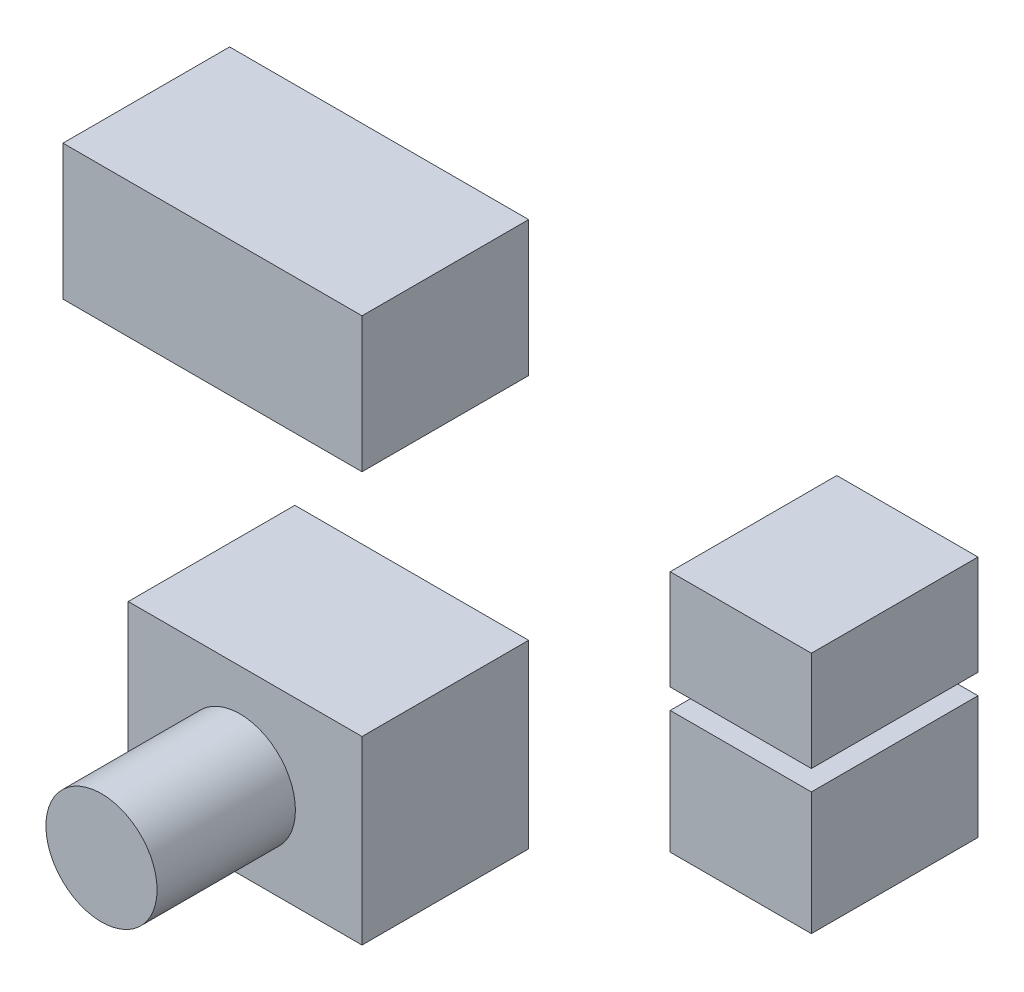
from build123d import *

# Parameters (mm, degrees)
SKETCH1_W          = 48.320688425
SKETCH1_H          = 21.83015873
EXTRUDE1_DEPTH     = 26.924
SKETCH1_W_2        = 22.81128946
SKETCH1_H_2        = 39.245229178
EXTRUDE1_2_DEPTH   = 26.924
SKETCH1_W_3        = 37.773533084
SKETCH1_H_3        = 29.188639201
EXTRUDE1_3_DEPTH   = 26.924
SKETCH3_R          = 8.982471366
EXTRUDE2_DEPTH     = 22.352
SKETCH4_W          = 32.540651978
SKETCH4_H          = 3.272651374
CUT_EXTRUDE2_DEPTH = 91.916895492


with BuildPart() as part:
    # Sketch1 → Extrude1 (new body)
    with BuildSketch(Plane.XY):
        with Locations((-46.726350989, 39.245229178)):
            Rectangle(SKETCH1_W, SKETCH1_H)
    extrude(amount=EXTRUDE1_DEPTH)


with BuildPart() as body_2:
    # Sketch1 → Extrude1 2 (new body)
    with BuildSketch(Plane.XY):
        with Locations((38.632022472, 19.622614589)):
            Rectangle(SKETCH1_W_2, SKETCH1_H_2)
    extrude(amount=EXTRUDE1_2_DEPTH)

    # Sketch4 → Cut-Extrude2 (cut, through all)
    with BuildSketch(Plane.XY.offset(26.924)):
        with Locations((39.114121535, 21.473099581)):
            Rectangle(SKETCH4_W, SKETCH4_H)
    extrude(amount=-CUT_EXTRUDE2_DEPTH, mode=Mode.SUBTRACT)


with BuildPart() as body_3:
    # Sketch1 → Extrude1 3 (new body)
    with BuildSketch(Plane.XY):
        with Locations((-41.452773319, -23.301854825)):
            Rectangle(SKETCH1_W_3, SKETCH1_H_3)
    extrude(amount=EXTRUDE1_3_DEPTH)


with BuildPart() as body_4:
    # Sketch3 → Extrude2 (new body)
    with BuildSketch(Plane.XY.offset(26.924)):
        with Locations((-42.309828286, -24.383799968)):
            Circle(SKETCH3_R)
    extrude(amount=EXTRUDE2_DEPTH)


with BuildPart() as cut_extrude2_piece_1:
    # of the separate pieces the step leaves, piece 1, a body of its own (cut_extrude2_pieces)
    add(body_2.part.solids().sort_by_distance((27.226377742, 0, 0))[0])


with BuildPart() as cut_extrude2_piece_2:
    # of the separate pieces the step leaves, piece 2, a body of its own (cut_extrude2_pieces)
    add(body_2.part.solids().sort_by_distance((27.226377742, 39.245229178, 0))[0])


solid = Compound([part.part, body_3.part, body_4.part, cut_extrude2_piece_1.part, cut_extrude2_piece_2.part])
